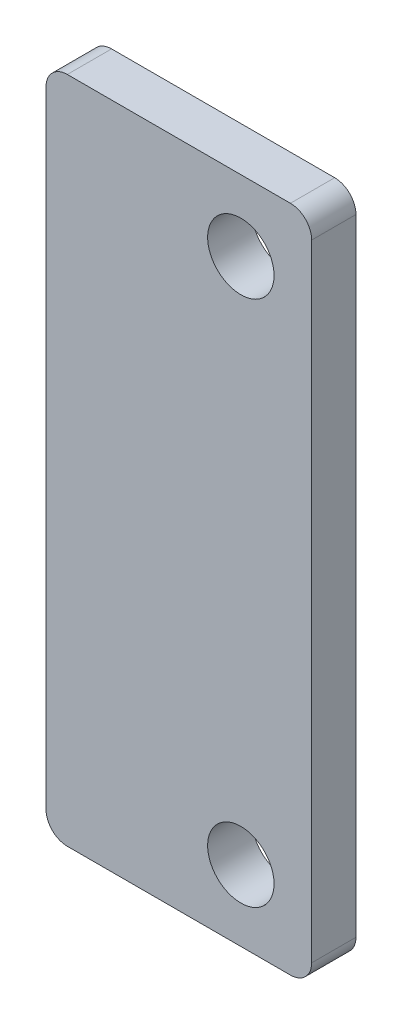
ISO-10303-21;
HEADER;
FILE_DESCRIPTION(('STEP AP214'),'2;1');
FILE_NAME('part.step','',(''),(''),'','','');
FILE_SCHEMA(('AUTOMOTIVE_DESIGN { 1 0 10303 214 1 1 1 1 }'));
ENDSEC;
DATA;
#1=APPLICATION_CONTEXT('core data for automotive mechanical design processes');
#2=APPLICATION_PROTOCOL_DEFINITION('international standard','automotive_design',2000,#1);
#3=PRODUCT_CONTEXT('',#1,'mechanical');
#4=PRODUCT('Part','Part','',(#3));
#5=PRODUCT_RELATED_PRODUCT_CATEGORY('part','',(#4));
#6=PRODUCT_DEFINITION_FORMATION('','',#4);
#7=PRODUCT_DEFINITION_CONTEXT('part definition',#1,'design');
#8=PRODUCT_DEFINITION('design','',#6,#7);
#9=PRODUCT_DEFINITION_SHAPE('','',#8);
#10=(LENGTH_UNIT() NAMED_UNIT(*) SI_UNIT(.MILLI.,.METRE.));
#11=(NAMED_UNIT(*) PLANE_ANGLE_UNIT() SI_UNIT($,.RADIAN.));
#12=(NAMED_UNIT(*) SI_UNIT($,.STERADIAN.) SOLID_ANGLE_UNIT());
#13=UNCERTAINTY_MEASURE_WITH_UNIT(LENGTH_MEASURE(1.E-05),#10,'distance_accuracy_value','');
#14=(GEOMETRIC_REPRESENTATION_CONTEXT(3) GLOBAL_UNCERTAINTY_ASSIGNED_CONTEXT((#13)) GLOBAL_UNIT_ASSIGNED_CONTEXT((#10,
#11,#12)) REPRESENTATION_CONTEXT('',''));
#15=CARTESIAN_POINT('',(0.,0.,0.));
#16=DIRECTION('',(0.,0.,1.));
#17=DIRECTION('',(1.,0.,0.));
#18=AXIS2_PLACEMENT_3D('',#15,#16,#17);
#19=CARTESIAN_POINT('',(-604.4565,152.019,3.175));
#20=DIRECTION('',(0.,0.,-1.));
#21=DIRECTION('',(-1.,0.,0.));
#22=AXIS2_PLACEMENT_3D('',#19,#20,#21);
#23=CYLINDRICAL_SURFACE('',#22,1.52399999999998);
#24=CARTESIAN_POINT('',(-604.4565,152.019,0.));
#25=DIRECTION('',(0.,0.,1.));
#26=DIRECTION('',(1.,0.,0.));
#27=AXIS2_PLACEMENT_3D('',#24,#25,#26);
#28=CIRCLE('',#27,1.52399999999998);
#29=CARTESIAN_POINT('',(-604.4565,150.495,0.));
#30=VERTEX_POINT('',#29);
#31=CARTESIAN_POINT('',(-602.9325,152.019,0.));
#32=VERTEX_POINT('',#31);
#33=EDGE_CURVE('E149',#30,#32,#28,.T.);
#34=ORIENTED_EDGE('',*,*,#33,.T.);
#35=DIRECTION('',(0.,0.,-1.));
#36=VECTOR('',#35,1.);
#37=CARTESIAN_POINT('',(-602.9325,152.019,3.175));
#38=LINE('',#37,#36);
#39=CARTESIAN_POINT('',(-602.9325,152.019,3.175));
#40=VERTEX_POINT('',#39);
#41=EDGE_CURVE('E11',#40,#32,#38,.T.);
#42=ORIENTED_EDGE('',*,*,#41,.F.);
#43=CARTESIAN_POINT('',(-604.4565,152.019,3.175));
#44=DIRECTION('',(0.,0.,1.));
#45=DIRECTION('',(1.,0.,0.));
#46=AXIS2_PLACEMENT_3D('',#43,#44,#45);
#47=CIRCLE('',#46,1.52399999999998);
#48=CARTESIAN_POINT('',(-604.4565,150.495,3.175));
#49=VERTEX_POINT('',#48);
#50=EDGE_CURVE('E172',#49,#40,#47,.T.);
#51=ORIENTED_EDGE('',*,*,#50,.F.);
#52=DIRECTION('',(0.,0.,-1.));
#53=VECTOR('',#52,1.);
#54=CARTESIAN_POINT('',(-604.4565,150.495,3.175));
#55=LINE('',#54,#53);
#56=EDGE_CURVE('E145',#49,#30,#55,.T.);
#57=ORIENTED_EDGE('',*,*,#56,.T.);
#58=EDGE_LOOP('',(#34,#42,#51,#57));
#59=FACE_BOUND('',#58,.T.);
#60=ADVANCED_FACE('F47',(#59),#23,.T.);
#61=CARTESIAN_POINT('',(-602.9325,152.019,3.175));
#62=DIRECTION('',(-1.,0.,0.));
#63=DIRECTION('',(0.,0.,1.));
#64=AXIS2_PLACEMENT_3D('',#61,#62,#63);
#65=PLANE('',#64);
#66=DIRECTION('',(0.,1.,0.));
#67=VECTOR('',#66,1.);
#68=CARTESIAN_POINT('',(-602.9325,152.019,0.));
#69=LINE('',#68,#67);
#70=CARTESIAN_POINT('',(-602.9325,196.9135,0.));
#71=VERTEX_POINT('',#70);
#72=EDGE_CURVE('E153',#32,#71,#69,.T.);
#73=ORIENTED_EDGE('',*,*,#72,.T.);
#74=DIRECTION('',(0.,0.,-1.));
#75=VECTOR('',#74,1.);
#76=CARTESIAN_POINT('',(-602.9325,196.9135,3.175));
#77=LINE('',#76,#75);
#78=CARTESIAN_POINT('',(-602.9325,196.9135,3.175));
#79=VERTEX_POINT('',#78);
#80=EDGE_CURVE('E56',#79,#71,#77,.T.);
#81=ORIENTED_EDGE('',*,*,#80,.F.);
#82=DIRECTION('',(0.,1.,0.));
#83=VECTOR('',#82,1.);
#84=CARTESIAN_POINT('',(-602.9325,152.019,3.175));
#85=LINE('',#84,#83);
#86=EDGE_CURVE('E107',#40,#79,#85,.T.);
#87=ORIENTED_EDGE('',*,*,#86,.F.);
#88=ORIENTED_EDGE('',*,*,#41,.T.);
#89=EDGE_LOOP('',(#73,#81,#87,#88));
#90=FACE_BOUND('',#89,.T.);
#91=ADVANCED_FACE('F259',(#90),#65,.F.);
#92=CARTESIAN_POINT('',(-604.4565,196.9135,3.175));
#93=DIRECTION('',(0.,0.,-1.));
#94=DIRECTION('',(-1.,0.,0.));
#95=AXIS2_PLACEMENT_3D('',#92,#93,#94);
#96=CYLINDRICAL_SURFACE('',#95,1.52399999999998);
#97=CARTESIAN_POINT('',(-604.4565,196.9135,0.));
#98=DIRECTION('',(0.,0.,1.));
#99=DIRECTION('',(-1.,0.,0.));
#100=AXIS2_PLACEMENT_3D('',#97,#98,#99);
#101=CIRCLE('',#100,1.52399999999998);
#102=CARTESIAN_POINT('',(-604.4565,198.4375,0.));
#103=VERTEX_POINT('',#102);
#104=EDGE_CURVE('E157',#71,#103,#101,.T.);
#105=ORIENTED_EDGE('',*,*,#104,.T.);
#106=DIRECTION('',(0.,0.,-1.));
#107=VECTOR('',#106,1.);
#108=CARTESIAN_POINT('',(-604.4565,198.4375,3.175));
#109=LINE('',#108,#107);
#110=CARTESIAN_POINT('',(-604.4565,198.4375,3.175));
#111=VERTEX_POINT('',#110);
#112=EDGE_CURVE('E183',#111,#103,#109,.T.);
#113=ORIENTED_EDGE('',*,*,#112,.F.);
#114=CARTESIAN_POINT('',(-604.4565,196.9135,3.175));
#115=DIRECTION('',(0.,0.,1.));
#116=DIRECTION('',(-1.,0.,0.));
#117=AXIS2_PLACEMENT_3D('',#114,#115,#116);
#118=CIRCLE('',#117,1.52399999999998);
#119=EDGE_CURVE('E194',#79,#111,#118,.T.);
#120=ORIENTED_EDGE('',*,*,#119,.F.);
#121=ORIENTED_EDGE('',*,*,#80,.T.);
#122=EDGE_LOOP('',(#105,#113,#120,#121));
#123=FACE_BOUND('',#122,.T.);
#124=ADVANCED_FACE('F192',(#123),#96,.T.);
#125=CARTESIAN_POINT('',(-620.4585,198.4375,3.175));
#126=DIRECTION('',(0.,-1.,0.));
#127=DIRECTION('',(0.,0.,-1.));
#128=AXIS2_PLACEMENT_3D('',#125,#126,#127);
#129=PLANE('',#128);
#130=DIRECTION('',(-1.,0.,0.));
#131=VECTOR('',#130,1.);
#132=CARTESIAN_POINT('',(-620.4585,198.4375,0.));
#133=LINE('',#132,#131);
#134=CARTESIAN_POINT('',(-620.4585,198.4375,0.));
#135=VERTEX_POINT('',#134);
#136=EDGE_CURVE('E160',#103,#135,#133,.T.);
#137=ORIENTED_EDGE('',*,*,#136,.T.);
#138=DIRECTION('',(0.,0.,-1.));
#139=VECTOR('',#138,1.);
#140=CARTESIAN_POINT('',(-620.4585,198.4375,3.175));
#141=LINE('',#140,#139);
#142=CARTESIAN_POINT('',(-620.4585,198.4375,3.175));
#143=VERTEX_POINT('',#142);
#144=EDGE_CURVE('E179',#143,#135,#141,.T.);
#145=ORIENTED_EDGE('',*,*,#144,.F.);
#146=DIRECTION('',(-1.,0.,0.));
#147=VECTOR('',#146,1.);
#148=CARTESIAN_POINT('',(-620.4585,198.4375,3.175));
#149=LINE('',#148,#147);
#150=EDGE_CURVE('E207',#111,#143,#149,.T.);
#151=ORIENTED_EDGE('',*,*,#150,.F.);
#152=ORIENTED_EDGE('',*,*,#112,.T.);
#153=EDGE_LOOP('',(#137,#145,#151,#152));
#154=FACE_BOUND('',#153,.T.);
#155=ADVANCED_FACE('F202',(#154),#129,.F.);
#156=CARTESIAN_POINT('',(-620.4585,196.9135,3.175));
#157=DIRECTION('',(0.,0.,-1.));
#158=DIRECTION('',(-1.,0.,0.));
#159=AXIS2_PLACEMENT_3D('',#156,#157,#158);
#160=CYLINDRICAL_SURFACE('',#159,1.52399999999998);
#161=CARTESIAN_POINT('',(-620.4585,196.9135,0.));
#162=DIRECTION('',(0.,0.,1.));
#163=DIRECTION('',(-1.,0.,0.));
#164=AXIS2_PLACEMENT_3D('',#161,#162,#163);
#165=CIRCLE('',#164,1.52399999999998);
#166=CARTESIAN_POINT('',(-621.9825,196.9135,0.));
#167=VERTEX_POINT('',#166);
#168=EDGE_CURVE('E163',#135,#167,#165,.T.);
#169=ORIENTED_EDGE('',*,*,#168,.T.);
#170=DIRECTION('',(0.,0.,-1.));
#171=VECTOR('',#170,1.);
#172=CARTESIAN_POINT('',(-621.9825,196.9135,3.175));
#173=LINE('',#172,#171);
#174=CARTESIAN_POINT('',(-621.9825,196.9135,3.175));
#175=VERTEX_POINT('',#174);
#176=EDGE_CURVE('E137',#175,#167,#173,.T.);
#177=ORIENTED_EDGE('',*,*,#176,.F.);
#178=CARTESIAN_POINT('',(-620.4585,196.9135,3.175));
#179=DIRECTION('',(0.,0.,1.));
#180=DIRECTION('',(-1.,0.,0.));
#181=AXIS2_PLACEMENT_3D('',#178,#179,#180);
#182=CIRCLE('',#181,1.52399999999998);
#183=EDGE_CURVE('E126',#143,#175,#182,.T.);
#184=ORIENTED_EDGE('',*,*,#183,.F.);
#185=ORIENTED_EDGE('',*,*,#144,.T.);
#186=EDGE_LOOP('',(#169,#177,#184,#185));
#187=FACE_BOUND('',#186,.T.);
#188=ADVANCED_FACE('F205',(#187),#160,.T.);
#189=CARTESIAN_POINT('',(-621.9825,152.019,3.175));
#190=DIRECTION('',(1.,0.,0.));
#191=DIRECTION('',(0.,0.,-1.));
#192=AXIS2_PLACEMENT_3D('',#189,#190,#191);
#193=PLANE('',#192);
#194=DIRECTION('',(0.,-1.,0.));
#195=VECTOR('',#194,1.);
#196=CARTESIAN_POINT('',(-621.9825,152.019,0.));
#197=LINE('',#196,#195);
#198=CARTESIAN_POINT('',(-621.9825,152.019,0.));
#199=VERTEX_POINT('',#198);
#200=EDGE_CURVE('E135',#167,#199,#197,.T.);
#201=ORIENTED_EDGE('',*,*,#200,.T.);
#202=DIRECTION('',(0.,0.,-1.));
#203=VECTOR('',#202,1.);
#204=CARTESIAN_POINT('',(-621.9825,152.019,3.175));
#205=LINE('',#204,#203);
#206=CARTESIAN_POINT('',(-621.9825,152.019,3.175));
#207=VERTEX_POINT('',#206);
#208=EDGE_CURVE('E132',#207,#199,#205,.T.);
#209=ORIENTED_EDGE('',*,*,#208,.F.);
#210=DIRECTION('',(0.,-1.,0.));
#211=VECTOR('',#210,1.);
#212=CARTESIAN_POINT('',(-621.9825,152.019,3.175));
#213=LINE('',#212,#211);
#214=EDGE_CURVE('E120',#175,#207,#213,.T.);
#215=ORIENTED_EDGE('',*,*,#214,.F.);
#216=ORIENTED_EDGE('',*,*,#176,.T.);
#217=EDGE_LOOP('',(#201,#209,#215,#216));
#218=FACE_BOUND('',#217,.T.);
#219=ADVANCED_FACE('F133',(#218),#193,.F.);
#220=CARTESIAN_POINT('',(-620.4585,152.019,3.175));
#221=DIRECTION('',(0.,0.,-1.));
#222=DIRECTION('',(-1.,0.,0.));
#223=AXIS2_PLACEMENT_3D('',#220,#221,#222);
#224=CYLINDRICAL_SURFACE('',#223,1.52399999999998);
#225=CARTESIAN_POINT('',(-620.4585,152.019,0.));
#226=DIRECTION('',(0.,0.,1.));
#227=DIRECTION('',(-1.,0.,0.));
#228=AXIS2_PLACEMENT_3D('',#225,#226,#227);
#229=CIRCLE('',#228,1.52399999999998);
#230=CARTESIAN_POINT('',(-620.4585,150.495,0.));
#231=VERTEX_POINT('',#230);
#232=EDGE_CURVE('E93',#199,#231,#229,.T.);
#233=ORIENTED_EDGE('',*,*,#232,.T.);
#234=DIRECTION('',(0.,0.,-1.));
#235=VECTOR('',#234,1.);
#236=CARTESIAN_POINT('',(-620.4585,150.495,3.175));
#237=LINE('',#236,#235);
#238=CARTESIAN_POINT('',(-620.4585,150.495,3.175));
#239=VERTEX_POINT('',#238);
#240=EDGE_CURVE('E138',#239,#231,#237,.T.);
#241=ORIENTED_EDGE('',*,*,#240,.F.);
#242=CARTESIAN_POINT('',(-620.4585,152.019,3.175));
#243=DIRECTION('',(0.,0.,1.));
#244=DIRECTION('',(-1.,0.,0.));
#245=AXIS2_PLACEMENT_3D('',#242,#243,#244);
#246=CIRCLE('',#245,1.52399999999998);
#247=EDGE_CURVE('E124',#207,#239,#246,.T.);
#248=ORIENTED_EDGE('',*,*,#247,.F.);
#249=ORIENTED_EDGE('',*,*,#208,.T.);
#250=EDGE_LOOP('',(#233,#241,#248,#249));
#251=FACE_BOUND('',#250,.T.);
#252=ADVANCED_FACE('F140',(#251),#224,.T.);
#253=CARTESIAN_POINT('',(-620.4585,150.495,3.175));
#254=DIRECTION('',(0.,1.,0.));
#255=DIRECTION('',(0.,0.,1.));
#256=AXIS2_PLACEMENT_3D('',#253,#254,#255);
#257=PLANE('',#256);
#258=DIRECTION('',(1.,0.,0.));
#259=VECTOR('',#258,1.);
#260=CARTESIAN_POINT('',(-620.4585,150.495,0.));
#261=LINE('',#260,#259);
#262=EDGE_CURVE('E99',#231,#30,#261,.T.);
#263=ORIENTED_EDGE('',*,*,#262,.T.);
#264=ORIENTED_EDGE('',*,*,#56,.F.);
#265=DIRECTION('',(1.,0.,0.));
#266=VECTOR('',#265,1.);
#267=CARTESIAN_POINT('',(-620.4585,150.495,3.175));
#268=LINE('',#267,#266);
#269=EDGE_CURVE('E64',#239,#49,#268,.T.);
#270=ORIENTED_EDGE('',*,*,#269,.F.);
#271=ORIENTED_EDGE('',*,*,#240,.T.);
#272=EDGE_LOOP('',(#263,#264,#270,#271));
#273=FACE_BOUND('',#272,.T.);
#274=ADVANCED_FACE('F246',(#273),#257,.F.);
#275=CARTESIAN_POINT('',(-604.4565,152.019,3.175));
#276=DIRECTION('',(0.,0.,1.));
#277=DIRECTION('',(1.,0.,0.));
#278=AXIS2_PLACEMENT_3D('',#275,#276,#277);
#279=PLANE('',#278);
#280=CARTESIAN_POINT('',(-608.0125,193.3575,3.175));
#281=DIRECTION('',(0.,0.,1.));
#282=DIRECTION('',(1.,0.,0.));
#283=AXIS2_PLACEMENT_3D('',#280,#281,#282);
#284=CIRCLE('',#283,2.38125);
#285=CARTESIAN_POINT('',(-605.63125,193.3575,3.175));
#286=VERTEX_POINT('',#285);
#287=EDGE_CURVE('E225',#286,#286,#284,.T.);
#288=ORIENTED_EDGE('',*,*,#287,.F.);
#289=EDGE_LOOP('',(#288));
#290=FACE_BOUND('',#289,.T.);
#291=CARTESIAN_POINT('',(-608.0125,155.575,3.175));
#292=DIRECTION('',(0.,0.,1.));
#293=DIRECTION('',(1.,0.,0.));
#294=AXIS2_PLACEMENT_3D('',#291,#292,#293);
#295=CIRCLE('',#294,2.38125);
#296=CARTESIAN_POINT('',(-605.63125,155.575,3.175));
#297=VERTEX_POINT('',#296);
#298=EDGE_CURVE('E154',#297,#297,#295,.T.);
#299=ORIENTED_EDGE('',*,*,#298,.F.);
#300=EDGE_LOOP('',(#299));
#301=FACE_BOUND('',#300,.T.);
#302=ORIENTED_EDGE('',*,*,#50,.T.);
#303=ORIENTED_EDGE('',*,*,#86,.T.);
#304=ORIENTED_EDGE('',*,*,#119,.T.);
#305=ORIENTED_EDGE('',*,*,#150,.T.);
#306=ORIENTED_EDGE('',*,*,#183,.T.);
#307=ORIENTED_EDGE('',*,*,#214,.T.);
#308=ORIENTED_EDGE('',*,*,#247,.T.);
#309=ORIENTED_EDGE('',*,*,#269,.T.);
#310=EDGE_LOOP('',(#302,#303,#304,#305,#306,#307,#308,#309));
#311=FACE_BOUND('',#310,.T.);
#312=ADVANCED_FACE('F122',(#290,#301,#311),#279,.T.);
#313=CARTESIAN_POINT('',(-604.4565,152.019,0.));
#314=DIRECTION('',(0.,0.,1.));
#315=DIRECTION('',(1.,0.,0.));
#316=AXIS2_PLACEMENT_3D('',#313,#314,#315);
#317=PLANE('',#316);
#318=CARTESIAN_POINT('',(-608.0125,193.3575,0.));
#319=DIRECTION('',(0.,0.,1.));
#320=DIRECTION('',(1.,0.,0.));
#321=AXIS2_PLACEMENT_3D('',#318,#319,#320);
#322=CIRCLE('',#321,2.38125);
#323=CARTESIAN_POINT('',(-605.63125,193.3575,0.));
#324=VERTEX_POINT('',#323);
#325=EDGE_CURVE('E229',#324,#324,#322,.T.);
#326=ORIENTED_EDGE('',*,*,#325,.T.);
#327=EDGE_LOOP('',(#326));
#328=FACE_BOUND('',#327,.T.);
#329=CARTESIAN_POINT('',(-608.0125,155.575,0.));
#330=DIRECTION('',(0.,0.,1.));
#331=DIRECTION('',(1.,0.,0.));
#332=AXIS2_PLACEMENT_3D('',#329,#330,#331);
#333=CIRCLE('',#332,2.38125);
#334=CARTESIAN_POINT('',(-605.63125,155.575,0.));
#335=VERTEX_POINT('',#334);
#336=EDGE_CURVE('E221',#335,#335,#333,.T.);
#337=ORIENTED_EDGE('',*,*,#336,.T.);
#338=EDGE_LOOP('',(#337));
#339=FACE_BOUND('',#338,.T.);
#340=ORIENTED_EDGE('',*,*,#33,.F.);
#341=ORIENTED_EDGE('',*,*,#262,.F.);
#342=ORIENTED_EDGE('',*,*,#232,.F.);
#343=ORIENTED_EDGE('',*,*,#200,.F.);
#344=ORIENTED_EDGE('',*,*,#168,.F.);
#345=ORIENTED_EDGE('',*,*,#136,.F.);
#346=ORIENTED_EDGE('',*,*,#104,.F.);
#347=ORIENTED_EDGE('',*,*,#72,.F.);
#348=EDGE_LOOP('',(#340,#341,#342,#343,#344,#345,#346,#347));
#349=FACE_BOUND('',#348,.T.);
#350=ADVANCED_FACE('F198',(#328,#339,#349),#317,.F.);
#351=CARTESIAN_POINT('',(-608.0125,155.575,3.175));
#352=DIRECTION('',(0.,0.,1.));
#353=DIRECTION('',(1.,0.,0.));
#354=AXIS2_PLACEMENT_3D('',#351,#352,#353);
#355=CYLINDRICAL_SURFACE('',#354,2.38125);
#356=ORIENTED_EDGE('',*,*,#336,.F.);
#357=EDGE_LOOP('',(#356));
#358=FACE_BOUND('',#357,.T.);
#359=ORIENTED_EDGE('',*,*,#298,.T.);
#360=EDGE_LOOP('',(#359));
#361=FACE_BOUND('',#360,.T.);
#362=ADVANCED_FACE('F240',(#358,#361),#355,.F.);
#363=CARTESIAN_POINT('',(-608.0125,193.3575,3.175));
#364=DIRECTION('',(0.,0.,1.));
#365=DIRECTION('',(1.,0.,0.));
#366=AXIS2_PLACEMENT_3D('',#363,#364,#365);
#367=CYLINDRICAL_SURFACE('',#366,2.38125);
#368=ORIENTED_EDGE('',*,*,#325,.F.);
#369=EDGE_LOOP('',(#368));
#370=FACE_BOUND('',#369,.T.);
#371=ORIENTED_EDGE('',*,*,#287,.T.);
#372=EDGE_LOOP('',(#371));
#373=FACE_BOUND('',#372,.T.);
#374=ADVANCED_FACE('F237',(#370,#373),#367,.F.);
#375=CLOSED_SHELL('',(#60,#91,#124,#155,#188,#219,#252,#274,#312,#350,#362,#374));
#376=MANIFOLD_SOLID_BREP('B2',#375);
#377=ADVANCED_BREP_SHAPE_REPRESENTATION('',(#18,#376),#14);
#378=SHAPE_DEFINITION_REPRESENTATION(#9,#377);
ENDSEC;
END-ISO-10303-21;
